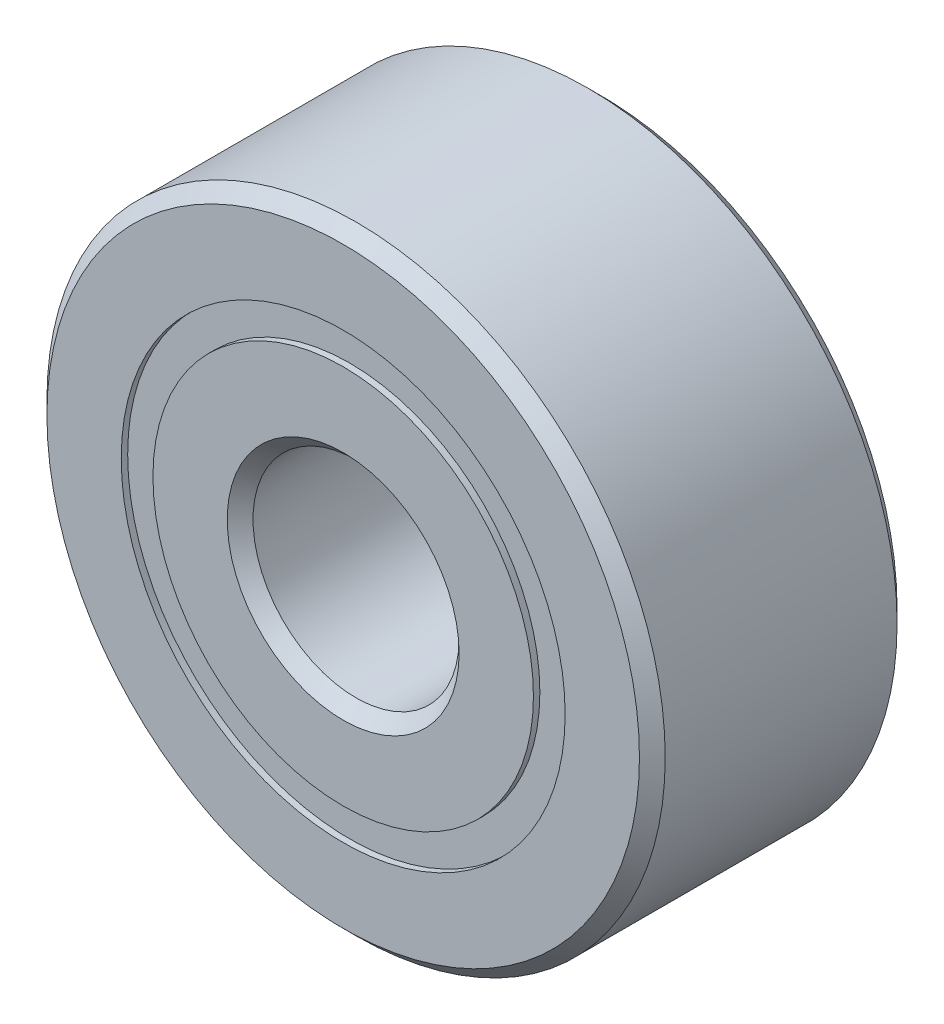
from build123d import *

# Parameters (mm, degrees)
CIRPATTERN1_COUNT = 10
SKETCH5_W         = 0.970019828
SKETCH5_H         = 0.488461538


with BuildPart() as part:
    # Sketch1 → Revolve1 (revolve)
    with BuildSketch(Plane(origin=(0, 0, 0), x_dir=(0, 0, -1), z_dir=(1, 0, 0)), mode=Mode.PRIVATE) as revolve1_sk:
        with BuildLine():
            Line((1.7859375, 4.7625), (-1.7859375, 4.7625))
            Line((-1.7859375, 4.7625), (-1.984375, 4.5640625))
            Line((-1.984375, 4.5640625), (-1.984375, 3.419230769))
            Line((-1.984375, 3.419230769), (-0.881944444, 3.419230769))
            ThreePointArc((-0.881944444, 3.419230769), (0, 4.090136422), (0.881944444, 3.419230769))
            Line((0.881944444, 3.419230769), (1.984375, 3.419230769))
            Line((1.984375, 3.419230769), (1.984375, 4.5640625))
            Line((1.984375, 4.5640625), (1.7859375, 4.7625))
        make_face()
    revolve(revolve1_sk.sketch.rotate(Axis((0, 0, 1.984375), (0, 0, -1)), 90), axis=Axis((0, 0, 1.984375), (0, 0, -1)))


with BuildPart() as body_2:
    # Sketch3 → Revolve3 (revolve)
    with BuildSketch(Plane(origin=(0, 0, 0), x_dir=(0, 0, -1), z_dir=(1, 0, 0)), mode=Mode.PRIVATE) as revolve3_sk:
        with BuildLine():
            Line((-0.881944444, 2.930769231), (-1.984375, 2.930769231))
            Line((-1.984375, 2.930769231), (-1.984375, 1.7859375))
            Line((-1.984375, 1.7859375), (-1.7859375, 1.5875))
            Line((-1.7859375, 1.5875), (1.7859375, 1.5875))
            Line((1.7859375, 1.5875), (1.984375, 1.7859375))
            Line((1.984375, 1.7859375), (1.984375, 2.930769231))
            Line((1.984375, 2.930769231), (0.881944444, 2.930769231))
            ThreePointArc((0.881944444, 2.930769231), (0, 2.259863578), (-0.881944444, 2.930769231))
        make_face()
    revolve(revolve3_sk.sketch.rotate(Axis((0, 0, 1.984375), (0, 0, -1)), 90), axis=Axis((0, 0, 1.984375), (0, 0, -1)))


with BuildPart() as body_3:
    # Sketch4 → Revolve4 (revolve)
    with BuildSketch(Plane(origin=(0, 0, 0), x_dir=(0, 0, -1), z_dir=(1, 0, 0))):
        with BuildLine():
            Line((-0.915136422, 3.175), (0.915136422, 3.175))
            ThreePointArc((0.915136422, 3.175), (0, 4.090136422), (-0.915136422, 3.175))
        make_face()
    revolve(axis=Axis((0, 3.175, 0.915136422), (0, 0, -1)))


with BuildPart() as cirpattern1_1:
    # CirPattern1: pattern copy
    add(body_3.part.rotate(Axis((0, 0, 0), (0, 0, 1)), 1 * 360 / CIRPATTERN1_COUNT))


with BuildPart() as cirpattern1_2:
    # CirPattern1: pattern copy
    add(body_3.part.rotate(Axis((0, 0, 0), (0, 0, 1)), 2 * 360 / CIRPATTERN1_COUNT))


with BuildPart() as cirpattern1_3:
    # CirPattern1: pattern copy
    add(body_3.part.rotate(Axis((0, 0, 0), (0, 0, 1)), 3 * 360 / CIRPATTERN1_COUNT))


with BuildPart() as cirpattern1_4:
    # CirPattern1: pattern copy
    add(body_3.part.rotate(Axis((0, 0, 0), (0, 0, 1)), 4 * 360 / CIRPATTERN1_COUNT))


with BuildPart() as cirpattern1_5:
    # CirPattern1: pattern copy
    add(body_3.part.rotate(Axis((0, 0, 0), (0, 0, 1)), 5 * 360 / CIRPATTERN1_COUNT))


with BuildPart() as cirpattern1_6:
    # CirPattern1: pattern copy
    add(body_3.part.rotate(Axis((0, 0, 0), (0, 0, 1)), 6 * 360 / CIRPATTERN1_COUNT))


with BuildPart() as cirpattern1_7:
    # CirPattern1: pattern copy
    add(body_3.part.rotate(Axis((0, 0, 0), (0, 0, 1)), 7 * 360 / CIRPATTERN1_COUNT))


with BuildPart() as cirpattern1_8:
    # CirPattern1: pattern copy
    add(body_3.part.rotate(Axis((0, 0, 0), (0, 0, 1)), 8 * 360 / CIRPATTERN1_COUNT))


with BuildPart() as cirpattern1_9:
    # CirPattern1: pattern copy
    add(body_3.part.rotate(Axis((0, 0, 0), (0, 0, 1)), 9 * 360 / CIRPATTERN1_COUNT))


with BuildPart() as body_13:
    # Sketch5 → Revolve5 (revolve)
    with BuildSketch(Plane(origin=(0, 0, 0), x_dir=(0, 0, -1), z_dir=(1, 0, 0)), mode=Mode.PRIVATE) as revolve5_sk:
        with Locations((-1.400146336, 3.175)):
            Rectangle(SKETCH5_W, SKETCH5_H)
        with Locations((1.400146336, 3.175)):
            Rectangle(SKETCH5_W, SKETCH5_H)
    revolve(revolve5_sk.sketch.rotate(Axis((0, 0, 1.984375), (0, 0, -1)), 90), axis=Axis((0, 0, 1.984375), (0, 0, -1)))


solid = Compound([part.part, body_2.part, body_3.part, cirpattern1_1.part, cirpattern1_2.part, cirpattern1_3.part, cirpattern1_4.part, cirpattern1_5.part, cirpattern1_6.part, cirpattern1_7.part, cirpattern1_8.part, cirpattern1_9.part, body_13.part])
